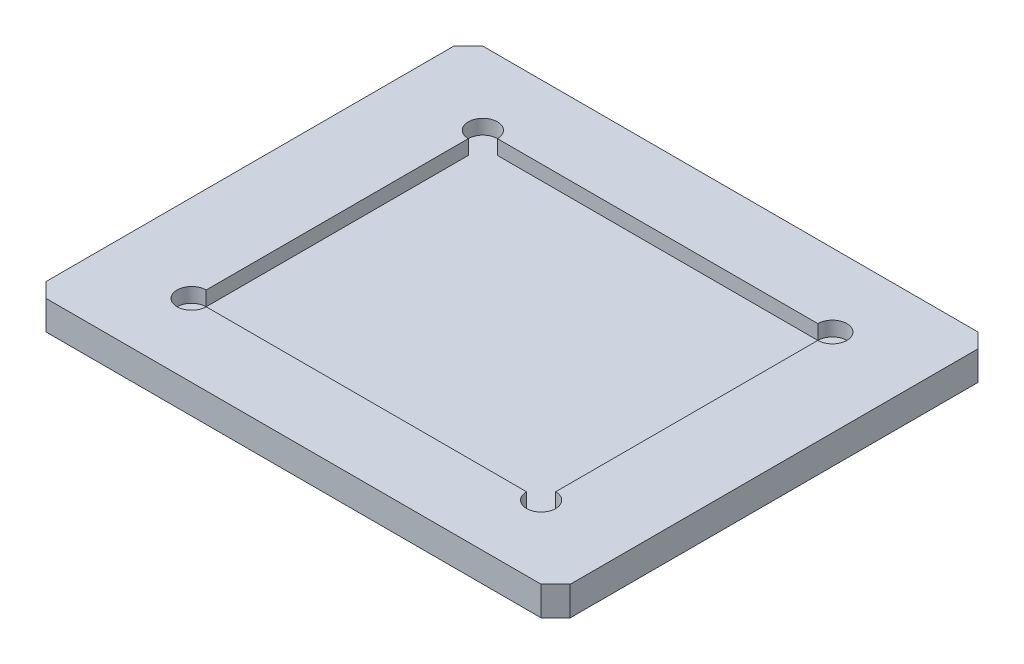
from build123d import *

# Parameters (mm, degrees)
SKETCH_1_W          = 180
SKETCH_1_H          = 150
EXTRUDE_1_DEPTH     = 10
SKETCH_2_W          = 120
SKETCH_2_H          = 100
CUT_EXTRUDE_1_DEPTH = 5
CUT_EXTRUDE_2_DEPTH = 5
CHAMFER_1_SIZE      = 5


with BuildPart() as part:
    # Sketch 1 → Extrude 1 (new body)
    with BuildSketch(Plane(origin=(0, 10, 0), x_dir=(1, 0, 0), z_dir=(0, 1, 0))):
        Rectangle(SKETCH_1_W, SKETCH_1_H)
    extrude(amount=-EXTRUDE_1_DEPTH)

    # Sketch 2 → Cut-Extrude 1 (cut)
    with BuildSketch(Plane(origin=(0, 10, 0), x_dir=(-1, 0, 0), z_dir=(0, 1, 0))):
        Rectangle(SKETCH_2_W, SKETCH_2_H)
    extrude(amount=-CUT_EXTRUDE_1_DEPTH, mode=Mode.SUBTRACT)

    # Sketch 3 → Cut-Extrude 2 (cut)
    with BuildSketch(Plane(origin=(0, 10, 0), x_dir=(1, 0, 0), z_dir=(0, 1, 0))):
        with BuildLine():
            Line((60, 50), (55, 50))
            ThreePointArc((55, 50), (56.464466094, 46.464466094), (60, 45))
            Line((60, 45), (60, 50))
        make_face()
        with BuildLine():
            ThreePointArc((65, 50), (60, 55), (55, 50))
            Line((55, 50), (60, 50))
            Line((60, 50), (60, 45))
            ThreePointArc((60, 45), (63.535533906, 46.464466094), (65, 50))
        make_face()
        with BuildLine():
            Line((60, -50), (60, -45))
            ThreePointArc((60, -45), (56.464466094, -46.464466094), (55, -50))
            Line((55, -50), (60, -50))
        make_face()
        with BuildLine():
            ThreePointArc((65, -50), (63.535533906, -46.464466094), (60, -45))
            Line((60, -45), (60, -50))
            Line((60, -50), (55, -50))
            ThreePointArc((55, -50), (60, -55), (65, -50))
        make_face()
        with BuildLine():
            Line((-60, -50), (-60, -45))
            ThreePointArc((-60, -45), (-63.535533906, -53.535533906), (-55, -50))
            Line((-55, -50), (-60, -50))
        make_face()
        with BuildLine():
            ThreePointArc((-55, -50), (-56.464466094, -46.464466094), (-60, -45))
            Line((-60, -45), (-60, -50))
            Line((-60, -50), (-55, -50))
        make_face()
        with BuildLine():
            Line((-60, 50), (-55, 50))
            ThreePointArc((-55, 50), (-63.535533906, 53.535533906), (-60, 45))
            Line((-60, 45), (-60, 50))
        make_face()
        with BuildLine():
            ThreePointArc((-60, 45), (-56.464466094, 46.464466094), (-55, 50))
            Line((-55, 50), (-60, 50))
            Line((-60, 50), (-60, 45))
        make_face()
    extrude(amount=-CUT_EXTRUDE_2_DEPTH, mode=Mode.SUBTRACT)

    # Chamfer 1
    chamfer_1_edges = [part.edges().sort_by_distance(p)[0] for p in [
        (90, 5, 75),
        (-90, 5, 75),
        (-90, 5, -75),
        (90, 5, -75),
    ]]
    chamfer(chamfer_1_edges, length=CHAMFER_1_SIZE)


solid = part.part
